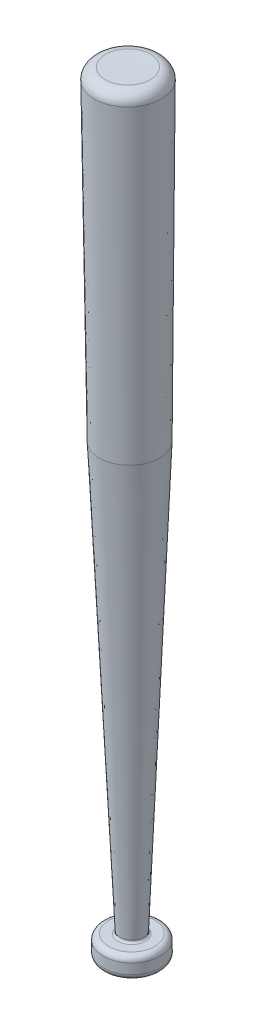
from build123d import *


with BuildPart() as part:
    # Sketch1 → Revolve1 (revolve)
    with BuildSketch(Plane.XY):
        with BuildLine():
            Line((0, 0), (-10.473409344, 0))
            ThreePointArc((-10.473409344, 0), (-12.269460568, 0.743948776), (-13.013409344, 2.54))
            Line((-13.013409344, 2.54), (-13.013409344, 7.091648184))
            ThreePointArc((-13.013409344, 7.091648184), (-12.269460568, 8.887699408), (-10.473409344, 9.631648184))
            Line((-10.473409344, 9.631648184), (-6.281962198, 9.631648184))
            ThreePointArc((-6.281962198, 9.631648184), (-5.567329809, 9.991041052), (-5.429722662, 10.779030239))
            Line((-5.429722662, 10.779030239), (-14.755782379, 203.225125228))
            Line((-14.755782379, 203.225125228), (-17.042749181, 345.076461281))
            ThreePointArc((-17.042749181, 345.076461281), (-15.596720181, 348.690464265), (-12.006497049, 350.194563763))
            Line((-12.006497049, 350.194563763), (-1.84695997, 350.194563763))
            Line((-1.84695997, 350.194563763), (0, 0))
        make_face()
    revolve(axis=Axis((-1.84695997, 350.194563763, 0), (0.0052740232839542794, -0.9999860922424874, 0)))


solid = part.part
